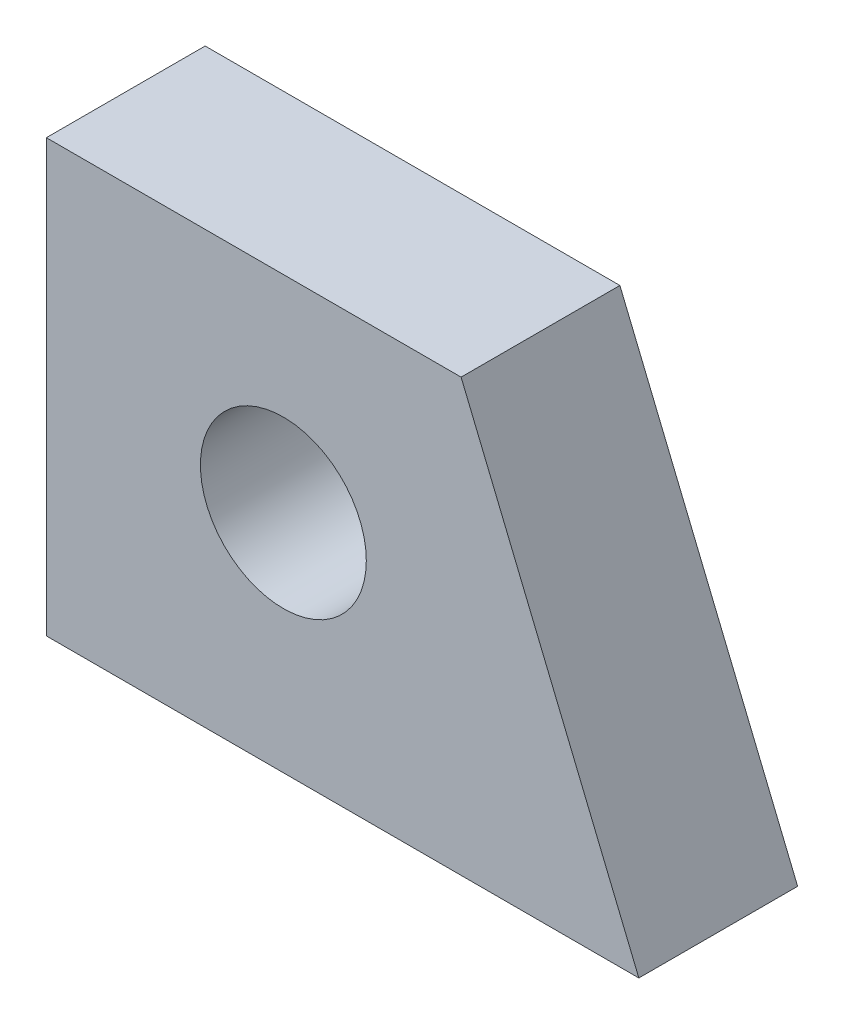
ISO-10303-21;
HEADER;
FILE_DESCRIPTION(('STEP AP214'),'2;1');
FILE_NAME('part.step','',(''),(''),'','','');
FILE_SCHEMA(('AUTOMOTIVE_DESIGN { 1 0 10303 214 1 1 1 1 }'));
ENDSEC;
DATA;
#1=APPLICATION_CONTEXT('core data for automotive mechanical design processes');
#2=APPLICATION_PROTOCOL_DEFINITION('international standard','automotive_design',2000,#1);
#3=PRODUCT_CONTEXT('',#1,'mechanical');
#4=PRODUCT('Part','Part','',(#3));
#5=PRODUCT_RELATED_PRODUCT_CATEGORY('part','',(#4));
#6=PRODUCT_DEFINITION_FORMATION('','',#4);
#7=PRODUCT_DEFINITION_CONTEXT('part definition',#1,'design');
#8=PRODUCT_DEFINITION('design','',#6,#7);
#9=PRODUCT_DEFINITION_SHAPE('','',#8);
#10=(LENGTH_UNIT() NAMED_UNIT(*) SI_UNIT(.MILLI.,.METRE.));
#11=(NAMED_UNIT(*) PLANE_ANGLE_UNIT() SI_UNIT($,.RADIAN.));
#12=(NAMED_UNIT(*) SI_UNIT($,.STERADIAN.) SOLID_ANGLE_UNIT());
#13=UNCERTAINTY_MEASURE_WITH_UNIT(LENGTH_MEASURE(1.E-05),#10,'distance_accuracy_value','');
#14=(GEOMETRIC_REPRESENTATION_CONTEXT(3) GLOBAL_UNCERTAINTY_ASSIGNED_CONTEXT((#13)) GLOBAL_UNIT_ASSIGNED_CONTEXT((#10,
#11,#12)) REPRESENTATION_CONTEXT('',''));
#15=CARTESIAN_POINT('',(0.,0.,0.));
#16=DIRECTION('',(0.,0.,1.));
#17=DIRECTION('',(1.,0.,0.));
#18=AXIS2_PLACEMENT_3D('',#15,#16,#17);
#19=CARTESIAN_POINT('',(120.,8.72131405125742,26.8));
#20=DIRECTION('',(0.,0.,-1.));
#21=DIRECTION('',(-1.,0.,0.));
#22=AXIS2_PLACEMENT_3D('',#19,#20,#21);
#23=PLANE('',#22);
#24=DIRECTION('',(-0.380871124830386,0.924628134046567,0.));
#25=VECTOR('',#24,1.);
#26=CARTESIAN_POINT('',(120.,8.72131405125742,26.8));
#27=LINE('',#26,#25);
#28=CARTESIAN_POINT('',(120.,8.72131405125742,26.8));
#29=VERTEX_POINT('',#28);
#30=CARTESIAN_POINT('',(90.,81.5513140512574,26.8));
#31=VERTEX_POINT('',#30);
#32=EDGE_CURVE('E100',#29,#31,#27,.T.);
#33=ORIENTED_EDGE('',*,*,#32,.T.);
#34=DIRECTION('',(-1.,0.,0.));
#35=VECTOR('',#34,1.);
#36=CARTESIAN_POINT('',(20.,81.5513140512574,26.8));
#37=LINE('',#36,#35);
#38=CARTESIAN_POINT('',(20.,81.5513140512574,26.8));
#39=VERTEX_POINT('',#38);
#40=EDGE_CURVE('E85',#31,#39,#37,.T.);
#41=ORIENTED_EDGE('',*,*,#40,.T.);
#42=DIRECTION('',(0.,-1.,0.));
#43=VECTOR('',#42,1.);
#44=CARTESIAN_POINT('',(20.,8.72131405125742,26.8));
#45=LINE('',#44,#43);
#46=CARTESIAN_POINT('',(20.,8.72131405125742,26.8));
#47=VERTEX_POINT('',#46);
#48=EDGE_CURVE('E51',#39,#47,#45,.T.);
#49=ORIENTED_EDGE('',*,*,#48,.T.);
#50=DIRECTION('',(1.,0.,0.));
#51=VECTOR('',#50,1.);
#52=CARTESIAN_POINT('',(20.,8.72131405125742,26.8));
#53=LINE('',#52,#51);
#54=EDGE_CURVE('E46',#47,#29,#53,.T.);
#55=ORIENTED_EDGE('',*,*,#54,.T.);
#56=EDGE_LOOP('',(#33,#41,#49,#55));
#57=FACE_BOUND('',#56,.T.);
#58=CARTESIAN_POINT('',(60.,46.7213140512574,26.8));
#59=DIRECTION('',(0.,0.,1.));
#60=DIRECTION('',(1.,0.,0.));
#61=AXIS2_PLACEMENT_3D('',#58,#59,#60);
#62=CIRCLE('',#61,14.);
#63=CARTESIAN_POINT('',(74.,46.7213140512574,26.8));
#64=VERTEX_POINT('',#63);
#65=EDGE_CURVE('E90',#64,#64,#62,.T.);
#66=ORIENTED_EDGE('',*,*,#65,.F.);
#67=EDGE_LOOP('',(#66));
#68=FACE_BOUND('',#67,.T.);
#69=ADVANCED_FACE('F31',(#57,#68),#23,.F.);
#70=CARTESIAN_POINT('',(120.,8.72131405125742,0.));
#71=DIRECTION('',(0.,0.,-1.));
#72=DIRECTION('',(-1.,0.,0.));
#73=AXIS2_PLACEMENT_3D('',#70,#71,#72);
#74=PLANE('',#73);
#75=DIRECTION('',(-0.380871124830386,0.924628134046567,0.));
#76=VECTOR('',#75,1.);
#77=CARTESIAN_POINT('',(120.,8.72131405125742,0.));
#78=LINE('',#77,#76);
#79=CARTESIAN_POINT('',(120.,8.72131405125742,0.));
#80=VERTEX_POINT('',#79);
#81=CARTESIAN_POINT('',(90.,81.5513140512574,0.));
#82=VERTEX_POINT('',#81);
#83=EDGE_CURVE('E77',#80,#82,#78,.T.);
#84=ORIENTED_EDGE('',*,*,#83,.F.);
#85=DIRECTION('',(1.,0.,0.));
#86=VECTOR('',#85,1.);
#87=CARTESIAN_POINT('',(20.,8.72131405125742,0.));
#88=LINE('',#87,#86);
#89=CARTESIAN_POINT('',(20.,8.72131405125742,0.));
#90=VERTEX_POINT('',#89);
#91=EDGE_CURVE('E98',#90,#80,#88,.T.);
#92=ORIENTED_EDGE('',*,*,#91,.F.);
#93=DIRECTION('',(0.,-1.,0.));
#94=VECTOR('',#93,1.);
#95=CARTESIAN_POINT('',(20.,8.72131405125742,0.));
#96=LINE('',#95,#94);
#97=CARTESIAN_POINT('',(20.,81.5513140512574,0.));
#98=VERTEX_POINT('',#97);
#99=EDGE_CURVE('E78',#98,#90,#96,.T.);
#100=ORIENTED_EDGE('',*,*,#99,.F.);
#101=DIRECTION('',(-1.,0.,0.));
#102=VECTOR('',#101,1.);
#103=CARTESIAN_POINT('',(20.,81.5513140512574,0.));
#104=LINE('',#103,#102);
#105=EDGE_CURVE('E72',#82,#98,#104,.T.);
#106=ORIENTED_EDGE('',*,*,#105,.F.);
#107=EDGE_LOOP('',(#84,#92,#100,#106));
#108=FACE_BOUND('',#107,.T.);
#109=CARTESIAN_POINT('',(60.,46.7213140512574,0.));
#110=DIRECTION('',(0.,0.,1.));
#111=DIRECTION('',(1.,0.,0.));
#112=AXIS2_PLACEMENT_3D('',#109,#110,#111);
#113=CIRCLE('',#112,14.);
#114=CARTESIAN_POINT('',(74.,46.7213140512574,0.));
#115=VERTEX_POINT('',#114);
#116=EDGE_CURVE('E93',#115,#115,#113,.T.);
#117=ORIENTED_EDGE('',*,*,#116,.T.);
#118=EDGE_LOOP('',(#117));
#119=FACE_BOUND('',#118,.T.);
#120=ADVANCED_FACE('F73',(#108,#119),#74,.T.);
#121=CARTESIAN_POINT('',(120.,8.72131405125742,26.8));
#122=DIRECTION('',(-0.924628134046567,-0.380871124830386,0.));
#123=DIRECTION('',(0.380871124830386,-0.924628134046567,0.));
#124=AXIS2_PLACEMENT_3D('',#121,#122,#123);
#125=PLANE('',#124);
#126=ORIENTED_EDGE('',*,*,#83,.T.);
#127=DIRECTION('',(0.,0.,-1.));
#128=VECTOR('',#127,1.);
#129=CARTESIAN_POINT('',(90.,81.5513140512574,26.8));
#130=LINE('',#129,#128);
#131=EDGE_CURVE('E11',#31,#82,#130,.T.);
#132=ORIENTED_EDGE('',*,*,#131,.F.);
#133=ORIENTED_EDGE('',*,*,#32,.F.);
#134=DIRECTION('',(0.,0.,-1.));
#135=VECTOR('',#134,1.);
#136=CARTESIAN_POINT('',(120.,8.72131405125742,26.8));
#137=LINE('',#136,#135);
#138=EDGE_CURVE('E89',#29,#80,#137,.T.);
#139=ORIENTED_EDGE('',*,*,#138,.T.);
#140=EDGE_LOOP('',(#126,#132,#133,#139));
#141=FACE_BOUND('',#140,.T.);
#142=ADVANCED_FACE('F33',(#141),#125,.F.);
#143=CARTESIAN_POINT('',(20.,81.5513140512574,26.8));
#144=DIRECTION('',(0.,-1.,0.));
#145=DIRECTION('',(1.,0.,0.));
#146=AXIS2_PLACEMENT_3D('',#143,#144,#145);
#147=PLANE('',#146);
#148=ORIENTED_EDGE('',*,*,#105,.T.);
#149=DIRECTION('',(0.,0.,-1.));
#150=VECTOR('',#149,1.);
#151=CARTESIAN_POINT('',(20.,81.5513140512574,26.8));
#152=LINE('',#151,#150);
#153=EDGE_CURVE('E39',#39,#98,#152,.T.);
#154=ORIENTED_EDGE('',*,*,#153,.F.);
#155=ORIENTED_EDGE('',*,*,#40,.F.);
#156=ORIENTED_EDGE('',*,*,#131,.T.);
#157=EDGE_LOOP('',(#148,#154,#155,#156));
#158=FACE_BOUND('',#157,.T.);
#159=ADVANCED_FACE('F84',(#158),#147,.F.);
#160=CARTESIAN_POINT('',(20.,8.72131405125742,26.8));
#161=DIRECTION('',(1.,0.,0.));
#162=DIRECTION('',(0.,0.,-1.));
#163=AXIS2_PLACEMENT_3D('',#160,#161,#162);
#164=PLANE('',#163);
#165=ORIENTED_EDGE('',*,*,#99,.T.);
#166=DIRECTION('',(0.,0.,-1.));
#167=VECTOR('',#166,1.);
#168=CARTESIAN_POINT('',(20.,8.72131405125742,26.8));
#169=LINE('',#168,#167);
#170=EDGE_CURVE('E106',#47,#90,#169,.T.);
#171=ORIENTED_EDGE('',*,*,#170,.F.);
#172=ORIENTED_EDGE('',*,*,#48,.F.);
#173=ORIENTED_EDGE('',*,*,#153,.T.);
#174=EDGE_LOOP('',(#165,#171,#172,#173));
#175=FACE_BOUND('',#174,.T.);
#176=ADVANCED_FACE('F109',(#175),#164,.F.);
#177=CARTESIAN_POINT('',(20.,8.72131405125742,26.8));
#178=DIRECTION('',(0.,1.,0.));
#179=DIRECTION('',(0.,0.,1.));
#180=AXIS2_PLACEMENT_3D('',#177,#178,#179);
#181=PLANE('',#180);
#182=ORIENTED_EDGE('',*,*,#91,.T.);
#183=ORIENTED_EDGE('',*,*,#138,.F.);
#184=ORIENTED_EDGE('',*,*,#54,.F.);
#185=ORIENTED_EDGE('',*,*,#170,.T.);
#186=EDGE_LOOP('',(#182,#183,#184,#185));
#187=FACE_BOUND('',#186,.T.);
#188=ADVANCED_FACE('F111',(#187),#181,.F.);
#189=CARTESIAN_POINT('',(60.,46.7213140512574,26.8));
#190=DIRECTION('',(0.,0.,-1.));
#191=DIRECTION('',(-1.,0.,0.));
#192=AXIS2_PLACEMENT_3D('',#189,#190,#191);
#193=CYLINDRICAL_SURFACE('',#192,14.);
#194=ORIENTED_EDGE('',*,*,#65,.T.);
#195=EDGE_LOOP('',(#194));
#196=FACE_BOUND('',#195,.T.);
#197=ORIENTED_EDGE('',*,*,#116,.F.);
#198=EDGE_LOOP('',(#197));
#199=FACE_BOUND('',#198,.T.);
#200=ADVANCED_FACE('F117',(#196,#199),#193,.F.);
#201=CLOSED_SHELL('',(#69,#120,#142,#159,#176,#188,#200));
#202=MANIFOLD_SOLID_BREP('B2',#201);
#203=ADVANCED_BREP_SHAPE_REPRESENTATION('',(#18,#202),#14);
#204=SHAPE_DEFINITION_REPRESENTATION(#9,#203);
ENDSEC;
END-ISO-10303-21;
